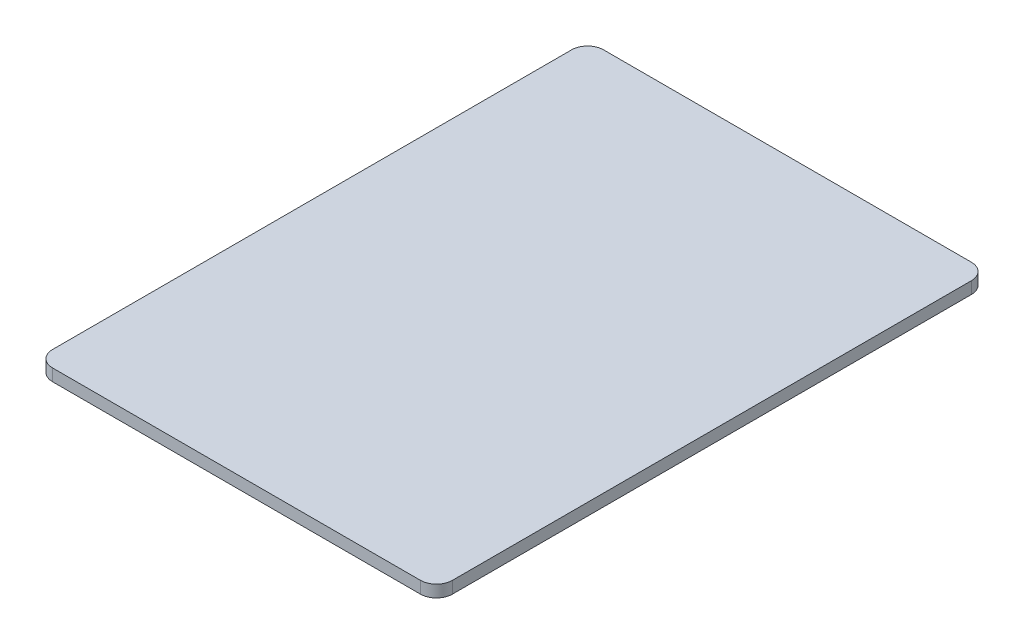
ISO-10303-21;
HEADER;
FILE_DESCRIPTION(('STEP AP214'),'2;1');
FILE_NAME('part.step','',(''),(''),'','','');
FILE_SCHEMA(('AUTOMOTIVE_DESIGN { 1 0 10303 214 1 1 1 1 }'));
ENDSEC;
DATA;
#1=APPLICATION_CONTEXT('core data for automotive mechanical design processes');
#2=APPLICATION_PROTOCOL_DEFINITION('international standard','automotive_design',2000,#1);
#3=PRODUCT_CONTEXT('',#1,'mechanical');
#4=PRODUCT('Part','Part','',(#3));
#5=PRODUCT_RELATED_PRODUCT_CATEGORY('part','',(#4));
#6=PRODUCT_DEFINITION_FORMATION('','',#4);
#7=PRODUCT_DEFINITION_CONTEXT('part definition',#1,'design');
#8=PRODUCT_DEFINITION('design','',#6,#7);
#9=PRODUCT_DEFINITION_SHAPE('','',#8);
#10=(LENGTH_UNIT() NAMED_UNIT(*) SI_UNIT(.MILLI.,.METRE.));
#11=(NAMED_UNIT(*) PLANE_ANGLE_UNIT() SI_UNIT($,.RADIAN.));
#12=(NAMED_UNIT(*) SI_UNIT($,.STERADIAN.) SOLID_ANGLE_UNIT());
#13=UNCERTAINTY_MEASURE_WITH_UNIT(LENGTH_MEASURE(1.E-05),#10,'distance_accuracy_value','');
#14=(GEOMETRIC_REPRESENTATION_CONTEXT(3) GLOBAL_UNCERTAINTY_ASSIGNED_CONTEXT((#13)) GLOBAL_UNIT_ASSIGNED_CONTEXT((#10,
#11,#12)) REPRESENTATION_CONTEXT('',''));
#15=CARTESIAN_POINT('',(0.,0.,0.));
#16=DIRECTION('',(0.,0.,1.));
#17=DIRECTION('',(1.,0.,0.));
#18=AXIS2_PLACEMENT_3D('',#15,#16,#17);
#19=CARTESIAN_POINT('',(0.,7.62,0.));
#20=DIRECTION('',(1.,0.,0.));
#21=DIRECTION('',(0.,0.,-1.));
#22=AXIS2_PLACEMENT_3D('',#19,#20,#21);
#23=PLANE('',#22);
#24=DIRECTION('',(0.,0.,1.));
#25=VECTOR('',#24,1.);
#26=CARTESIAN_POINT('',(0.,0.,0.));
#27=LINE('',#26,#25);
#28=CARTESIAN_POINT('',(0.,0.,-339.852));
#29=VERTEX_POINT('',#28);
#30=CARTESIAN_POINT('',(0.,0.,-205.486));
#31=VERTEX_POINT('',#30);
#32=EDGE_CURVE('E173',#29,#31,#27,.T.);
#33=ORIENTED_EDGE('',*,*,#32,.T.);
#34=CARTESIAN_POINT('',(0.,0.,-200.406));
#35=DIRECTION('',(-1.,0.,0.));
#36=DIRECTION('',(0.,0.,1.));
#37=AXIS2_PLACEMENT_3D('',#34,#35,#36);
#38=CIRCLE('',#37,5.08);
#39=CARTESIAN_POINT('',(0.,5.08,-200.406));
#40=VERTEX_POINT('',#39);
#41=EDGE_CURVE('E153',#40,#31,#38,.T.);
#42=ORIENTED_EDGE('',*,*,#41,.F.);
#43=DIRECTION('',(0.,0.,-1.));
#44=VECTOR('',#43,1.);
#45=CARTESIAN_POINT('',(0.,5.08,-200.406));
#46=LINE('',#45,#44);
#47=CARTESIAN_POINT('',(0.,5.08000000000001,-149.606));
#48=VERTEX_POINT('',#47);
#49=EDGE_CURVE('E156',#48,#40,#46,.T.);
#50=ORIENTED_EDGE('',*,*,#49,.F.);
#51=CARTESIAN_POINT('',(0.,0.,-149.606));
#52=DIRECTION('',(-1.,0.,0.));
#53=DIRECTION('',(0.,0.,1.));
#54=AXIS2_PLACEMENT_3D('',#51,#52,#53);
#55=CIRCLE('',#54,5.08);
#56=CARTESIAN_POINT('',(0.,0.,-144.526));
#57=VERTEX_POINT('',#56);
#58=EDGE_CURVE('E143',#57,#48,#55,.T.);
#59=ORIENTED_EDGE('',*,*,#58,.F.);
#60=CARTESIAN_POINT('',(0.,0.,-10.16));
#61=VERTEX_POINT('',#60);
#62=EDGE_CURVE('E158',#57,#61,#27,.T.);
#63=ORIENTED_EDGE('',*,*,#62,.T.);
#64=DIRECTION('',(0.,-1.,0.));
#65=VECTOR('',#64,1.);
#66=CARTESIAN_POINT('',(0.,7.62,-10.16));
#67=LINE('',#66,#65);
#68=CARTESIAN_POINT('',(0.,7.62,-10.16));
#69=VERTEX_POINT('',#68);
#70=EDGE_CURVE('E172',#61,#69,#67,.F.);
#71=ORIENTED_EDGE('',*,*,#70,.T.);
#72=DIRECTION('',(0.,0.,1.));
#73=VECTOR('',#72,1.);
#74=CARTESIAN_POINT('',(0.,7.62,0.));
#75=LINE('',#74,#73);
#76=CARTESIAN_POINT('',(0.,7.62,-339.852));
#77=VERTEX_POINT('',#76);
#78=EDGE_CURVE('E160',#77,#69,#75,.T.);
#79=ORIENTED_EDGE('',*,*,#78,.F.);
#80=DIRECTION('',(0.,-1.,0.));
#81=VECTOR('',#80,1.);
#82=CARTESIAN_POINT('',(0.,7.62,-339.852));
#83=LINE('',#82,#81);
#84=EDGE_CURVE('E184',#77,#29,#83,.T.);
#85=ORIENTED_EDGE('',*,*,#84,.T.);
#86=EDGE_LOOP('',(#33,#42,#50,#59,#63,#71,#79,#85));
#87=FACE_BOUND('',#86,.T.);
#88=ADVANCED_FACE('F40',(#87),#23,.F.);
#89=CARTESIAN_POINT('',(0.,7.62,0.));
#90=DIRECTION('',(0.,0.,-1.));
#91=DIRECTION('',(-1.,0.,0.));
#92=AXIS2_PLACEMENT_3D('',#89,#90,#91);
#93=PLANE('',#92);
#94=DIRECTION('',(1.,0.,0.));
#95=VECTOR('',#94,1.);
#96=CARTESIAN_POINT('',(0.,7.62,0.));
#97=LINE('',#96,#95);
#98=CARTESIAN_POINT('',(10.16,7.62,0.));
#99=VERTEX_POINT('',#98);
#100=CARTESIAN_POINT('',(243.84,7.62,0.));
#101=VERTEX_POINT('',#100);
#102=EDGE_CURVE('E163',#99,#101,#97,.T.);
#103=ORIENTED_EDGE('',*,*,#102,.F.);
#104=DIRECTION('',(0.,-1.,0.));
#105=VECTOR('',#104,1.);
#106=CARTESIAN_POINT('',(10.16,7.62,0.));
#107=LINE('',#106,#105);
#108=CARTESIAN_POINT('',(10.16,0.,0.));
#109=VERTEX_POINT('',#108);
#110=EDGE_CURVE('E211',#99,#109,#107,.T.);
#111=ORIENTED_EDGE('',*,*,#110,.T.);
#112=DIRECTION('',(1.,0.,0.));
#113=VECTOR('',#112,1.);
#114=CARTESIAN_POINT('',(0.,0.,0.));
#115=LINE('',#114,#113);
#116=CARTESIAN_POINT('',(243.84,0.,0.));
#117=VERTEX_POINT('',#116);
#118=EDGE_CURVE('E176',#109,#117,#115,.T.);
#119=ORIENTED_EDGE('',*,*,#118,.T.);
#120=DIRECTION('',(0.,-1.,0.));
#121=VECTOR('',#120,1.);
#122=CARTESIAN_POINT('',(243.84,7.62,0.));
#123=LINE('',#122,#121);
#124=EDGE_CURVE('E209',#117,#101,#123,.F.);
#125=ORIENTED_EDGE('',*,*,#124,.T.);
#126=EDGE_LOOP('',(#103,#111,#119,#125));
#127=FACE_BOUND('',#126,.T.);
#128=ADVANCED_FACE('F256',(#127),#93,.F.);
#129=CARTESIAN_POINT('',(254.,7.62,0.));
#130=DIRECTION('',(-1.,0.,0.));
#131=DIRECTION('',(0.,0.,1.));
#132=AXIS2_PLACEMENT_3D('',#129,#130,#131);
#133=PLANE('',#132);
#134=DIRECTION('',(0.,0.,-1.));
#135=VECTOR('',#134,1.);
#136=CARTESIAN_POINT('',(254.,0.,0.));
#137=LINE('',#136,#135);
#138=CARTESIAN_POINT('',(254.,0.,-10.16));
#139=VERTEX_POINT('',#138);
#140=CARTESIAN_POINT('',(254.,0.,-339.852));
#141=VERTEX_POINT('',#140);
#142=EDGE_CURVE('E179',#139,#141,#137,.T.);
#143=ORIENTED_EDGE('',*,*,#142,.T.);
#144=DIRECTION('',(0.,-1.,0.));
#145=VECTOR('',#144,1.);
#146=CARTESIAN_POINT('',(254.,7.62,-339.852));
#147=LINE('',#146,#145);
#148=CARTESIAN_POINT('',(254.,7.62,-339.852));
#149=VERTEX_POINT('',#148);
#150=EDGE_CURVE('E62',#141,#149,#147,.F.);
#151=ORIENTED_EDGE('',*,*,#150,.T.);
#152=DIRECTION('',(0.,0.,-1.));
#153=VECTOR('',#152,1.);
#154=CARTESIAN_POINT('',(254.,7.62,0.));
#155=LINE('',#154,#153);
#156=CARTESIAN_POINT('',(254.,7.62,-10.16));
#157=VERTEX_POINT('',#156);
#158=EDGE_CURVE('E167',#157,#149,#155,.T.);
#159=ORIENTED_EDGE('',*,*,#158,.F.);
#160=DIRECTION('',(0.,-1.,0.));
#161=VECTOR('',#160,1.);
#162=CARTESIAN_POINT('',(254.,7.62,-10.16));
#163=LINE('',#162,#161);
#164=EDGE_CURVE('E214',#157,#139,#163,.T.);
#165=ORIENTED_EDGE('',*,*,#164,.T.);
#166=EDGE_LOOP('',(#143,#151,#159,#165));
#167=FACE_BOUND('',#166,.T.);
#168=ADVANCED_FACE('F261',(#167),#133,.F.);
#169=CARTESIAN_POINT('',(0.,7.62,-350.012));
#170=DIRECTION('',(0.,0.,1.));
#171=DIRECTION('',(1.,0.,0.));
#172=AXIS2_PLACEMENT_3D('',#169,#170,#171);
#173=PLANE('',#172);
#174=DIRECTION('',(-1.,0.,0.));
#175=VECTOR('',#174,1.);
#176=CARTESIAN_POINT('',(0.,0.,-350.012));
#177=LINE('',#176,#175);
#178=CARTESIAN_POINT('',(243.84,0.,-350.012));
#179=VERTEX_POINT('',#178);
#180=CARTESIAN_POINT('',(10.16,0.,-350.012));
#181=VERTEX_POINT('',#180);
#182=EDGE_CURVE('E164',#179,#181,#177,.T.);
#183=ORIENTED_EDGE('',*,*,#182,.T.);
#184=DIRECTION('',(0.,-1.,0.));
#185=VECTOR('',#184,1.);
#186=CARTESIAN_POINT('',(10.16,7.62,-350.012));
#187=LINE('',#186,#185);
#188=CARTESIAN_POINT('',(10.16,7.62,-350.012));
#189=VERTEX_POINT('',#188);
#190=EDGE_CURVE('E199',#181,#189,#187,.F.);
#191=ORIENTED_EDGE('',*,*,#190,.T.);
#192=DIRECTION('',(-1.,0.,0.));
#193=VECTOR('',#192,1.);
#194=CARTESIAN_POINT('',(0.,7.62,-350.012));
#195=LINE('',#194,#193);
#196=CARTESIAN_POINT('',(243.84,7.62,-350.012));
#197=VERTEX_POINT('',#196);
#198=EDGE_CURVE('E169',#197,#189,#195,.T.);
#199=ORIENTED_EDGE('',*,*,#198,.F.);
#200=DIRECTION('',(0.,-1.,0.));
#201=VECTOR('',#200,1.);
#202=CARTESIAN_POINT('',(243.84,7.62,-350.012));
#203=LINE('',#202,#201);
#204=EDGE_CURVE('E196',#197,#179,#203,.T.);
#205=ORIENTED_EDGE('',*,*,#204,.T.);
#206=EDGE_LOOP('',(#183,#191,#199,#205));
#207=FACE_BOUND('',#206,.T.);
#208=ADVANCED_FACE('F276',(#207),#173,.F.);
#209=CARTESIAN_POINT('',(0.,7.62,0.));
#210=DIRECTION('',(0.,-1.,0.));
#211=DIRECTION('',(0.,0.,-1.));
#212=AXIS2_PLACEMENT_3D('',#209,#210,#211);
#213=PLANE('',#212);
#214=ORIENTED_EDGE('',*,*,#198,.T.);
#215=CARTESIAN_POINT('',(10.16,7.62,-339.852));
#216=DIRECTION('',(0.,-1.,0.));
#217=DIRECTION('',(0.,0.,-1.));
#218=AXIS2_PLACEMENT_3D('',#215,#216,#217);
#219=CIRCLE('',#218,10.16);
#220=EDGE_CURVE('E207',#189,#77,#219,.F.);
#221=ORIENTED_EDGE('',*,*,#220,.T.);
#222=ORIENTED_EDGE('',*,*,#78,.T.);
#223=CARTESIAN_POINT('',(10.16,7.62,-10.16));
#224=DIRECTION('',(0.,-1.,0.));
#225=DIRECTION('',(0.,0.,-1.));
#226=AXIS2_PLACEMENT_3D('',#223,#224,#225);
#227=CIRCLE('',#226,10.16);
#228=EDGE_CURVE('E205',#69,#99,#227,.F.);
#229=ORIENTED_EDGE('',*,*,#228,.T.);
#230=ORIENTED_EDGE('',*,*,#102,.T.);
#231=CARTESIAN_POINT('',(243.84,7.62,-10.16));
#232=DIRECTION('',(0.,-1.,0.));
#233=DIRECTION('',(0.,0.,-1.));
#234=AXIS2_PLACEMENT_3D('',#231,#232,#233);
#235=CIRCLE('',#234,10.16);
#236=EDGE_CURVE('E201',#101,#157,#235,.F.);
#237=ORIENTED_EDGE('',*,*,#236,.T.);
#238=ORIENTED_EDGE('',*,*,#158,.T.);
#239=CARTESIAN_POINT('',(243.84,7.62,-339.852));
#240=DIRECTION('',(0.,-1.,0.));
#241=DIRECTION('',(0.,0.,-1.));
#242=AXIS2_PLACEMENT_3D('',#239,#240,#241);
#243=CIRCLE('',#242,10.16);
#244=EDGE_CURVE('E203',#149,#197,#243,.F.);
#245=ORIENTED_EDGE('',*,*,#244,.T.);
#246=EDGE_LOOP('',(#214,#221,#222,#229,#230,#237,#238,#245));
#247=FACE_BOUND('',#246,.T.);
#248=ADVANCED_FACE('F233',(#247),#213,.F.);
#249=CARTESIAN_POINT('',(0.,0.,0.));
#250=DIRECTION('',(0.,-1.,0.));
#251=DIRECTION('',(0.,0.,-1.));
#252=AXIS2_PLACEMENT_3D('',#249,#250,#251);
#253=PLANE('',#252);
#254=DIRECTION('',(-1.,0.,0.));
#255=VECTOR('',#254,1.);
#256=CARTESIAN_POINT('',(7.62,0.,-205.486));
#257=LINE('',#256,#255);
#258=CARTESIAN_POINT('',(7.62,0.,-205.486));
#259=VERTEX_POINT('',#258);
#260=EDGE_CURVE('E11',#31,#259,#257,.F.);
#261=ORIENTED_EDGE('',*,*,#260,.F.);
#262=ORIENTED_EDGE('',*,*,#32,.F.);
#263=CARTESIAN_POINT('',(10.16,0.,-339.852));
#264=DIRECTION('',(0.,-1.,0.));
#265=DIRECTION('',(0.,0.,-1.));
#266=AXIS2_PLACEMENT_3D('',#263,#264,#265);
#267=CIRCLE('',#266,10.16);
#268=EDGE_CURVE('E194',#29,#181,#267,.T.);
#269=ORIENTED_EDGE('',*,*,#268,.T.);
#270=ORIENTED_EDGE('',*,*,#182,.F.);
#271=CARTESIAN_POINT('',(243.84,0.,-339.852));
#272=DIRECTION('',(0.,-1.,0.));
#273=DIRECTION('',(0.,0.,-1.));
#274=AXIS2_PLACEMENT_3D('',#271,#272,#273);
#275=CIRCLE('',#274,10.16);
#276=EDGE_CURVE('E189',#179,#141,#275,.T.);
#277=ORIENTED_EDGE('',*,*,#276,.T.);
#278=ORIENTED_EDGE('',*,*,#142,.F.);
#279=CARTESIAN_POINT('',(243.84,0.,-10.16));
#280=DIRECTION('',(0.,-1.,0.));
#281=DIRECTION('',(0.,0.,-1.));
#282=AXIS2_PLACEMENT_3D('',#279,#280,#281);
#283=CIRCLE('',#282,10.16);
#284=EDGE_CURVE('E187',#139,#117,#283,.T.);
#285=ORIENTED_EDGE('',*,*,#284,.T.);
#286=ORIENTED_EDGE('',*,*,#118,.F.);
#287=CARTESIAN_POINT('',(10.16,0.,-10.16));
#288=DIRECTION('',(0.,-1.,0.));
#289=DIRECTION('',(0.,0.,-1.));
#290=AXIS2_PLACEMENT_3D('',#287,#288,#289);
#291=CIRCLE('',#290,10.16);
#292=EDGE_CURVE('E191',#109,#61,#291,.T.);
#293=ORIENTED_EDGE('',*,*,#292,.T.);
#294=ORIENTED_EDGE('',*,*,#62,.F.);
#295=DIRECTION('',(-1.,0.,0.));
#296=VECTOR('',#295,1.);
#297=CARTESIAN_POINT('',(7.62,0.,-144.526));
#298=LINE('',#297,#296);
#299=CARTESIAN_POINT('',(7.62,0.,-144.526));
#300=VERTEX_POINT('',#299);
#301=EDGE_CURVE('E48',#300,#57,#298,.T.);
#302=ORIENTED_EDGE('',*,*,#301,.F.);
#303=DIRECTION('',(0.,0.,-1.));
#304=VECTOR('',#303,1.);
#305=CARTESIAN_POINT('',(7.62,0.,0.));
#306=LINE('',#305,#304);
#307=EDGE_CURVE('E135',#300,#259,#306,.T.);
#308=ORIENTED_EDGE('',*,*,#307,.T.);
#309=EDGE_LOOP('',(#261,#262,#269,#270,#277,#278,#285,#286,#293,#294,#302,#308));
#310=FACE_BOUND('',#309,.T.);
#311=ADVANCED_FACE('F223',(#310),#253,.T.);
#312=CARTESIAN_POINT('',(10.16,7.62,-339.852));
#313=DIRECTION('',(0.,-1.,0.));
#314=DIRECTION('',(0.,0.,-1.));
#315=AXIS2_PLACEMENT_3D('',#312,#313,#314);
#316=CYLINDRICAL_SURFACE('',#315,10.16);
#317=ORIENTED_EDGE('',*,*,#220,.F.);
#318=ORIENTED_EDGE('',*,*,#190,.F.);
#319=ORIENTED_EDGE('',*,*,#268,.F.);
#320=ORIENTED_EDGE('',*,*,#84,.F.);
#321=EDGE_LOOP('',(#317,#318,#319,#320));
#322=FACE_BOUND('',#321,.T.);
#323=ADVANCED_FACE('F239',(#322),#316,.T.);
#324=CARTESIAN_POINT('',(10.16,7.62,-10.16));
#325=DIRECTION('',(0.,-1.,0.));
#326=DIRECTION('',(0.,0.,-1.));
#327=AXIS2_PLACEMENT_3D('',#324,#325,#326);
#328=CYLINDRICAL_SURFACE('',#327,10.16);
#329=ORIENTED_EDGE('',*,*,#228,.F.);
#330=ORIENTED_EDGE('',*,*,#70,.F.);
#331=ORIENTED_EDGE('',*,*,#292,.F.);
#332=ORIENTED_EDGE('',*,*,#110,.F.);
#333=EDGE_LOOP('',(#329,#330,#331,#332));
#334=FACE_BOUND('',#333,.T.);
#335=ADVANCED_FACE('F229',(#334),#328,.T.);
#336=CARTESIAN_POINT('',(243.84,7.62,-339.852));
#337=DIRECTION('',(0.,-1.,0.));
#338=DIRECTION('',(0.,0.,-1.));
#339=AXIS2_PLACEMENT_3D('',#336,#337,#338);
#340=CYLINDRICAL_SURFACE('',#339,10.16);
#341=ORIENTED_EDGE('',*,*,#244,.F.);
#342=ORIENTED_EDGE('',*,*,#150,.F.);
#343=ORIENTED_EDGE('',*,*,#276,.F.);
#344=ORIENTED_EDGE('',*,*,#204,.F.);
#345=EDGE_LOOP('',(#341,#342,#343,#344));
#346=FACE_BOUND('',#345,.T.);
#347=ADVANCED_FACE('F251',(#346),#340,.T.);
#348=CARTESIAN_POINT('',(243.84,7.62,-10.16));
#349=DIRECTION('',(0.,-1.,0.));
#350=DIRECTION('',(0.,0.,-1.));
#351=AXIS2_PLACEMENT_3D('',#348,#349,#350);
#352=CYLINDRICAL_SURFACE('',#351,10.16);
#353=ORIENTED_EDGE('',*,*,#236,.F.);
#354=ORIENTED_EDGE('',*,*,#124,.F.);
#355=ORIENTED_EDGE('',*,*,#284,.F.);
#356=ORIENTED_EDGE('',*,*,#164,.F.);
#357=EDGE_LOOP('',(#353,#354,#355,#356));
#358=FACE_BOUND('',#357,.T.);
#359=ADVANCED_FACE('F42',(#358),#352,.T.);
#360=CARTESIAN_POINT('',(7.62,0.,-200.406));
#361=DIRECTION('',(-1.,0.,0.));
#362=DIRECTION('',(0.,0.,1.));
#363=AXIS2_PLACEMENT_3D('',#360,#361,#362);
#364=CYLINDRICAL_SURFACE('',#363,5.08);
#365=ORIENTED_EDGE('',*,*,#260,.T.);
#366=CARTESIAN_POINT('',(7.62,0.,-200.406));
#367=DIRECTION('',(-1.,0.,0.));
#368=DIRECTION('',(0.,0.,1.));
#369=AXIS2_PLACEMENT_3D('',#366,#367,#368);
#370=CIRCLE('',#369,5.08);
#371=CARTESIAN_POINT('',(7.62,5.08,-200.406));
#372=VERTEX_POINT('',#371);
#373=EDGE_CURVE('E55',#372,#259,#370,.T.);
#374=ORIENTED_EDGE('',*,*,#373,.F.);
#375=DIRECTION('',(-1.,0.,0.));
#376=VECTOR('',#375,1.);
#377=CARTESIAN_POINT('',(7.62,5.08,-200.406));
#378=LINE('',#377,#376);
#379=EDGE_CURVE('E147',#372,#40,#378,.T.);
#380=ORIENTED_EDGE('',*,*,#379,.T.);
#381=ORIENTED_EDGE('',*,*,#41,.T.);
#382=EDGE_LOOP('',(#365,#374,#380,#381));
#383=FACE_BOUND('',#382,.T.);
#384=ADVANCED_FACE('F243',(#383),#364,.F.);
#385=CARTESIAN_POINT('',(7.62,5.08,-200.406));
#386=DIRECTION('',(0.,1.,0.));
#387=DIRECTION('',(0.,0.,1.));
#388=AXIS2_PLACEMENT_3D('',#385,#386,#387);
#389=PLANE('',#388);
#390=ORIENTED_EDGE('',*,*,#49,.T.);
#391=ORIENTED_EDGE('',*,*,#379,.F.);
#392=DIRECTION('',(0.,0.,-1.));
#393=VECTOR('',#392,1.);
#394=CARTESIAN_POINT('',(7.62,5.08,-200.406));
#395=LINE('',#394,#393);
#396=CARTESIAN_POINT('',(7.62,5.08000000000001,-149.606));
#397=VERTEX_POINT('',#396);
#398=EDGE_CURVE('E133',#397,#372,#395,.T.);
#399=ORIENTED_EDGE('',*,*,#398,.F.);
#400=DIRECTION('',(-1.,0.,0.));
#401=VECTOR('',#400,1.);
#402=CARTESIAN_POINT('',(7.62,5.08000000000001,-149.606));
#403=LINE('',#402,#401);
#404=EDGE_CURVE('E140',#397,#48,#403,.T.);
#405=ORIENTED_EDGE('',*,*,#404,.T.);
#406=EDGE_LOOP('',(#390,#391,#399,#405));
#407=FACE_BOUND('',#406,.T.);
#408=ADVANCED_FACE('F149',(#407),#389,.F.);
#409=CARTESIAN_POINT('',(7.62,0.,-149.606));
#410=DIRECTION('',(-1.,0.,0.));
#411=DIRECTION('',(0.,0.,1.));
#412=AXIS2_PLACEMENT_3D('',#409,#410,#411);
#413=CYLINDRICAL_SURFACE('',#412,5.08);
#414=ORIENTED_EDGE('',*,*,#301,.T.);
#415=ORIENTED_EDGE('',*,*,#58,.T.);
#416=ORIENTED_EDGE('',*,*,#404,.F.);
#417=CARTESIAN_POINT('',(7.62,0.,-149.606));
#418=DIRECTION('',(-1.,0.,0.));
#419=DIRECTION('',(0.,0.,1.));
#420=AXIS2_PLACEMENT_3D('',#417,#418,#419);
#421=CIRCLE('',#420,5.08);
#422=EDGE_CURVE('E129',#300,#397,#421,.T.);
#423=ORIENTED_EDGE('',*,*,#422,.F.);
#424=EDGE_LOOP('',(#414,#415,#416,#423));
#425=FACE_BOUND('',#424,.T.);
#426=ADVANCED_FACE('F141',(#425),#413,.F.);
#427=CARTESIAN_POINT('',(7.62,0.,-200.406));
#428=DIRECTION('',(-1.,0.,0.));
#429=DIRECTION('',(0.,0.,1.));
#430=AXIS2_PLACEMENT_3D('',#427,#428,#429);
#431=PLANE('',#430);
#432=ORIENTED_EDGE('',*,*,#422,.T.);
#433=ORIENTED_EDGE('',*,*,#398,.T.);
#434=ORIENTED_EDGE('',*,*,#373,.T.);
#435=ORIENTED_EDGE('',*,*,#307,.F.);
#436=EDGE_LOOP('',(#432,#433,#434,#435));
#437=FACE_BOUND('',#436,.T.);
#438=ADVANCED_FACE('F131',(#437),#431,.T.);
#439=CLOSED_SHELL('',(#88,#128,#168,#208,#248,#311,#323,#335,#347,#359,#384,#408,#426,#438));
#440=MANIFOLD_SOLID_BREP('B2',#439);
#441=ADVANCED_BREP_SHAPE_REPRESENTATION('',(#18,#440),#14);
#442=SHAPE_DEFINITION_REPRESENTATION(#9,#441);
ENDSEC;
END-ISO-10303-21;
